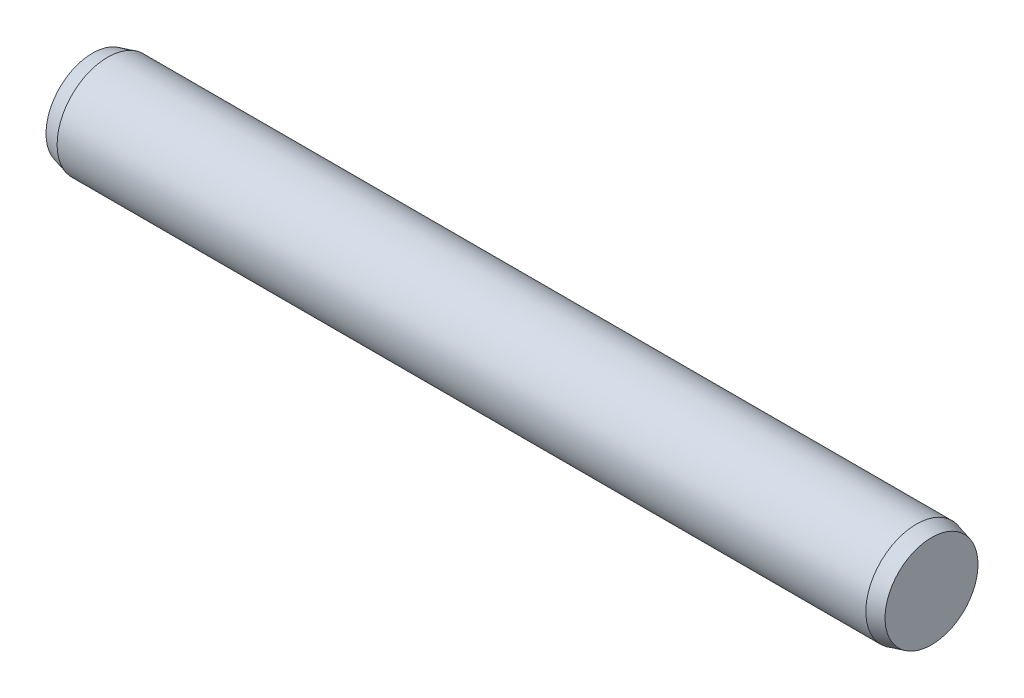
from build123d import *

# Parameters (mm, degrees)
EXTRUDE1_DEPTH      = 4
EXTRUDE1_DEPTH_BACK = 4
SKETCH2_R           = 0.5
SKETCH3_R           = 0.5
EXTRUDE2_DEPTH      = 0.15
EXTRUDE2_TAPER      = 15
SKETCH4_R           = 0.5
EXTRUDE3_DEPTH      = 0.15
EXTRUDE3_TAPER      = 15


with BuildPart() as part:
    # Sketch2 → Extrude1 (new, two sides: drawn at the far end of the back side and taken through both)
    with BuildSketch(Plane(origin=(0, 0, 0), x_dir=(0, 0, -1), z_dir=(1, 0, 0)).offset(-EXTRUDE1_DEPTH_BACK)):
        Circle(SKETCH2_R)
    extrude(amount=EXTRUDE1_DEPTH + EXTRUDE1_DEPTH_BACK)

    # Sketch3 → Extrude2 (add)
    with BuildSketch(Plane(origin=(4, 0, 0), x_dir=(0, 0, -1), z_dir=(1, 0, 0))):
        Circle(SKETCH3_R)
    extrude(amount=EXTRUDE2_DEPTH, taper=EXTRUDE2_TAPER)

    # Sketch4 → Extrude3 (add)
    with BuildSketch(Plane.ZY.offset(4)):
        with Locations(Location((0, 0, 0), (0, 0, 180))):
            Circle(SKETCH4_R)
    extrude(amount=EXTRUDE3_DEPTH, taper=EXTRUDE3_TAPER)


solid = part.part
